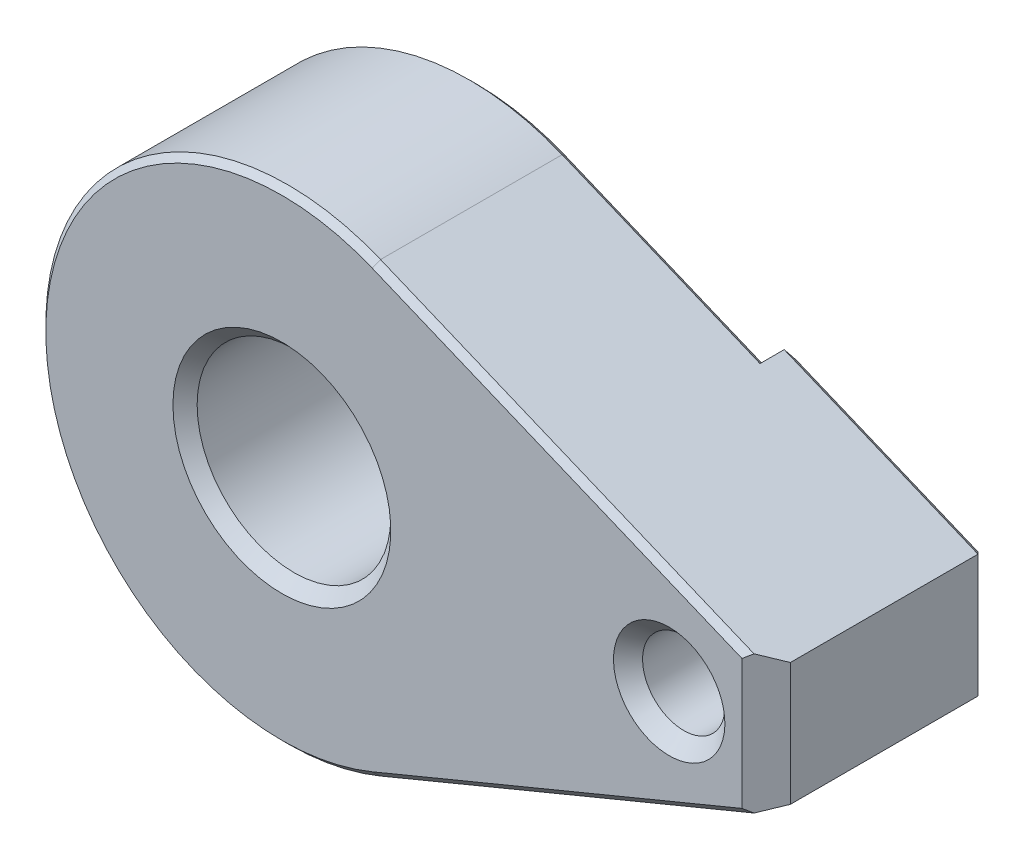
ISO-10303-21;
HEADER;
FILE_DESCRIPTION(('STEP AP214'),'2;1');
FILE_NAME('part.step','',(''),(''),'','','');
FILE_SCHEMA(('AUTOMOTIVE_DESIGN { 1 0 10303 214 1 1 1 1 }'));
ENDSEC;
DATA;
#1=APPLICATION_CONTEXT('core data for automotive mechanical design processes');
#2=APPLICATION_PROTOCOL_DEFINITION('international standard','automotive_design',2000,#1);
#3=PRODUCT_CONTEXT('',#1,'mechanical');
#4=PRODUCT('Part','Part','',(#3));
#5=PRODUCT_RELATED_PRODUCT_CATEGORY('part','',(#4));
#6=PRODUCT_DEFINITION_FORMATION('','',#4);
#7=PRODUCT_DEFINITION_CONTEXT('part definition',#1,'design');
#8=PRODUCT_DEFINITION('design','',#6,#7);
#9=PRODUCT_DEFINITION_SHAPE('','',#8);
#10=(LENGTH_UNIT() NAMED_UNIT(*) SI_UNIT(.MILLI.,.METRE.));
#11=(NAMED_UNIT(*) PLANE_ANGLE_UNIT() SI_UNIT($,.RADIAN.));
#12=(NAMED_UNIT(*) SI_UNIT($,.STERADIAN.) SOLID_ANGLE_UNIT());
#13=UNCERTAINTY_MEASURE_WITH_UNIT(LENGTH_MEASURE(1.E-05),#10,'distance_accuracy_value','');
#14=(GEOMETRIC_REPRESENTATION_CONTEXT(3) GLOBAL_UNCERTAINTY_ASSIGNED_CONTEXT((#13)) GLOBAL_UNIT_ASSIGNED_CONTEXT((#10,
#11,#12)) REPRESENTATION_CONTEXT('',''));
#15=CARTESIAN_POINT('',(0.,0.,0.));
#16=DIRECTION('',(0.,0.,1.));
#17=DIRECTION('',(1.,0.,0.));
#18=AXIS2_PLACEMENT_3D('',#15,#16,#17);
#19=CARTESIAN_POINT('',(24.,20.,0.));
#20=DIRECTION('',(0.,0.,1.));
#21=DIRECTION('',(0.,1.,0.));
#22=AXIS2_PLACEMENT_3D('',#19,#20,#21);
#23=PLANE('',#22);
#24=CARTESIAN_POINT('',(0.,0.,0.));
#25=DIRECTION('',(0.,0.,1.));
#26=DIRECTION('',(0.,1.,0.));
#27=AXIS2_PLACEMENT_3D('',#24,#25,#26);
#28=CIRCLE('',#27,8.5);
#29=CARTESIAN_POINT('',(0.,8.5,0.));
#30=VERTEX_POINT('',#29);
#31=EDGE_CURVE('E262',#30,#30,#28,.T.);
#32=ORIENTED_EDGE('',*,*,#31,.T.);
#33=EDGE_LOOP('',(#32));
#34=FACE_BOUND('',#33,.T.);
#35=DIRECTION('',(0.923879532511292,-0.382683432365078,0.));
#36=VECTOR('',#35,1.);
#37=CARTESIAN_POINT('',(23.8086582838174,11.2447787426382,0.));
#38=LINE('',#37,#36);
#39=CARTESIAN_POINT('',(7.46232693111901,18.0156508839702,0.));
#40=VERTEX_POINT('',#39);
#41=CARTESIAN_POINT('',(23.6,11.3312078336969,0.));
#42=VERTEX_POINT('',#41);
#43=EDGE_CURVE('E207',#40,#42,#38,.T.);
#44=ORIENTED_EDGE('',*,*,#43,.T.);
#45=DIRECTION('',(0.,-1.,0.));
#46=VECTOR('',#45,1.);
#47=CARTESIAN_POINT('',(23.6,-11.1655224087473,0.));
#48=LINE('',#47,#46);
#49=CARTESIAN_POINT('',(23.6,-11.3312078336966,0.));
#50=VERTEX_POINT('',#49);
#51=EDGE_CURVE('E220',#42,#50,#48,.T.);
#52=ORIENTED_EDGE('',*,*,#51,.T.);
#53=DIRECTION('',(-0.923879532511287,-0.382683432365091,0.));
#54=VECTOR('',#53,1.);
#55=CARTESIAN_POINT('',(7.46232693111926,-18.0156508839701,0.));
#56=LINE('',#55,#54);
#57=CARTESIAN_POINT('',(7.46232693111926,-18.0156508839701,0.));
#58=VERTEX_POINT('',#57);
#59=EDGE_CURVE('E212',#50,#58,#56,.T.);
#60=ORIENTED_EDGE('',*,*,#59,.T.);
#61=CARTESIAN_POINT('',(0.,0.,0.));
#62=DIRECTION('',(0.,0.,1.));
#63=DIRECTION('',(0.,1.,0.));
#64=AXIS2_PLACEMENT_3D('',#61,#62,#63);
#65=CIRCLE('',#64,19.5);
#66=EDGE_CURVE('E210',#58,#40,#65,.F.);
#67=ORIENTED_EDGE('',*,*,#66,.T.);
#68=EDGE_LOOP('',(#44,#52,#60,#67));
#69=FACE_BOUND('',#68,.T.);
#70=ADVANCED_FACE('F14',(#34,#69),#23,.F.);
#71=CARTESIAN_POINT('',(24.,20.,0.));
#72=DIRECTION('',(1.,0.,0.));
#73=DIRECTION('',(0.,1.,0.));
#74=AXIS2_PLACEMENT_3D('',#71,#72,#73);
#75=PLANE('',#74);
#76=DIRECTION('',(0.,0.734509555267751,-0.678598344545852));
#77=VECTOR('',#76,1.);
#78=CARTESIAN_POINT('',(24.,5.64841053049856,-15.5340485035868));
#79=LINE('',#78,#77);
#80=CARTESIAN_POINT('',(24.,-11.7067185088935,0.500000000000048));
#81=VERTEX_POINT('',#80);
#82=CARTESIAN_POINT('',(24.,-10.7325655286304,-0.399999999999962));
#83=VERTEX_POINT('',#82);
#84=EDGE_CURVE('E29',#81,#83,#79,.T.);
#85=ORIENTED_EDGE('',*,*,#84,.T.);
#86=DIRECTION('',(0.,-1.,0.));
#87=VECTOR('',#86,1.);
#88=CARTESIAN_POINT('',(24.,11.1655224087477,-0.400000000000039));
#89=LINE('',#88,#87);
#90=CARTESIAN_POINT('',(24.,10.7325655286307,-0.400000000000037));
#91=VERTEX_POINT('',#90);
#92=EDGE_CURVE('E228',#83,#91,#89,.F.);
#93=ORIENTED_EDGE('',*,*,#92,.T.);
#94=DIRECTION('',(0.,0.734509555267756,0.678598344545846));
#95=VECTOR('',#94,1.);
#96=CARTESIAN_POINT('',(24.,15.9317609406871,4.40343022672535));
#97=LINE('',#96,#95);
#98=CARTESIAN_POINT('',(24.,11.7067185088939,0.499999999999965));
#99=VERTEX_POINT('',#98);
#100=EDGE_CURVE('E36',#91,#99,#97,.T.);
#101=ORIENTED_EDGE('',*,*,#100,.T.);
#102=DIRECTION('',(0.,0.,1.));
#103=VECTOR('',#102,1.);
#104=CARTESIAN_POINT('',(24.,11.7067185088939,0.));
#105=LINE('',#104,#103);
#106=CARTESIAN_POINT('',(24.,11.7067185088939,-1.50000000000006));
#107=VERTEX_POINT('',#106);
#108=EDGE_CURVE('E239',#107,#99,#105,.T.);
#109=ORIENTED_EDGE('',*,*,#108,.F.);
#110=DIRECTION('',(0.,-1.,0.));
#111=VECTOR('',#110,1.);
#112=CARTESIAN_POINT('',(24.,20.,-1.50000000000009));
#113=LINE('',#112,#111);
#114=CARTESIAN_POINT('',(24.,-11.7067185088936,-1.49999999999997));
#115=VERTEX_POINT('',#114);
#116=EDGE_CURVE('E161',#107,#115,#113,.T.);
#117=ORIENTED_EDGE('',*,*,#116,.T.);
#118=DIRECTION('',(0.,0.,-1.));
#119=VECTOR('',#118,1.);
#120=CARTESIAN_POINT('',(24.,-11.7067185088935,0.));
#121=LINE('',#120,#119);
#122=EDGE_CURVE('E259',#81,#115,#121,.T.);
#123=ORIENTED_EDGE('',*,*,#122,.F.);
#124=EDGE_LOOP('',(#85,#93,#101,#109,#117,#123));
#125=FACE_BOUND('',#124,.T.);
#126=ADVANCED_FACE('F237',(#125),#75,.F.);
#127=CARTESIAN_POINT('',(24.,20.,-2.00000000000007));
#128=DIRECTION('',(0.,0.,1.));
#129=DIRECTION('',(1.,0.,0.));
#130=AXIS2_PLACEMENT_3D('',#127,#128,#129);
#131=PLANE('',#130);
#132=CARTESIAN_POINT('',(32.,2.16471843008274E-13,-2.));
#133=DIRECTION('',(0.,0.,1.));
#134=DIRECTION('',(1.,0.,0.));
#135=AXIS2_PLACEMENT_3D('',#132,#133,#134);
#136=CIRCLE('',#135,4.6);
#137=CARTESIAN_POINT('',(36.6,2.48593471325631E-13,-2.));
#138=VERTEX_POINT('',#137);
#139=EDGE_CURVE('E192',#138,#138,#136,.T.);
#140=ORIENTED_EDGE('',*,*,#139,.T.);
#141=EDGE_LOOP('',(#140));
#142=FACE_BOUND('',#141,.T.);
#143=DIRECTION('',(0.,-1.,0.));
#144=VECTOR('',#143,1.);
#145=CARTESIAN_POINT('',(39.51,-5.07515937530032,-2.));
#146=LINE('',#145,#144);
#147=CARTESIAN_POINT('',(39.51,4.74107005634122,-2.));
#148=VERTEX_POINT('',#147);
#149=CARTESIAN_POINT('',(39.51,-4.74107005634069,-2.));
#150=VERTEX_POINT('',#149);
#151=EDGE_CURVE('E153',#148,#150,#146,.T.);
#152=ORIENTED_EDGE('',*,*,#151,.T.);
#153=DIRECTION('',(-0.923879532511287,-0.382683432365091,0.));
#154=VECTOR('',#153,1.);
#155=CARTESIAN_POINT('',(23.8086582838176,-11.2447787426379,-1.99999999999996));
#156=LINE('',#155,#154);
#157=CARTESIAN_POINT('',(24.5,-10.9584156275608,-1.99999999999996));
#158=VERTEX_POINT('',#157);
#159=EDGE_CURVE('E155',#150,#158,#156,.T.);
#160=ORIENTED_EDGE('',*,*,#159,.T.);
#161=DIRECTION('',(0.,1.,0.));
#162=VECTOR('',#161,1.);
#163=CARTESIAN_POINT('',(24.5,20.,-2.00000000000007));
#164=LINE('',#163,#162);
#165=CARTESIAN_POINT('',(24.5,10.9584156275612,-2.00000000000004));
#166=VERTEX_POINT('',#165);
#167=EDGE_CURVE('E149',#158,#166,#164,.T.);
#168=ORIENTED_EDGE('',*,*,#167,.T.);
#169=DIRECTION('',(0.923879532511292,-0.382683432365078,0.));
#170=VECTOR('',#169,1.);
#171=CARTESIAN_POINT('',(39.8186582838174,4.61321960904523,-2.));
#172=LINE('',#171,#170);
#173=EDGE_CURVE('E151',#166,#148,#172,.T.);
#174=ORIENTED_EDGE('',*,*,#173,.T.);
#175=EDGE_LOOP('',(#152,#160,#168,#174));
#176=FACE_BOUND('',#175,.T.);
#177=ADVANCED_FACE('F320',(#142,#176),#131,.F.);
#178=CARTESIAN_POINT('',(35.3073372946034,-7.02306604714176,-2.));
#179=DIRECTION('',(0.382683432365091,-0.923879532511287,0.));
#180=DIRECTION('',(0.923879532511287,0.382683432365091,0.));
#181=AXIS2_PLACEMENT_3D('',#178,#179,#180);
#182=PLANE('',#181);
#183=DIRECTION('',(0.,0.,1.));
#184=VECTOR('',#183,1.);
#185=CARTESIAN_POINT('',(7.65366864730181,-18.4775906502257,-1.99999999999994));
#186=LINE('',#185,#184);
#187=CARTESIAN_POINT('',(7.65366864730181,-18.4775906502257,0.500000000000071));
#188=VERTEX_POINT('',#187);
#189=CARTESIAN_POINT('',(7.65366864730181,-18.4775906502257,15.5));
#190=VERTEX_POINT('',#189);
#191=EDGE_CURVE('E251',#188,#190,#186,.T.);
#192=ORIENTED_EDGE('',*,*,#191,.F.);
#193=DIRECTION('',(0.923879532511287,0.382683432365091,0.));
#194=VECTOR('',#193,1.);
#195=CARTESIAN_POINT('',(24.,-11.7067185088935,0.500000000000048));
#196=LINE('',#195,#194);
#197=EDGE_CURVE('E204',#188,#81,#196,.T.);
#198=ORIENTED_EDGE('',*,*,#197,.T.);
#199=ORIENTED_EDGE('',*,*,#122,.T.);
#200=DIRECTION('',(0.923879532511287,0.382683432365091,0.));
#201=VECTOR('',#200,1.);
#202=CARTESIAN_POINT('',(40.01,-5.07515937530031,-1.5));
#203=LINE('',#202,#201);
#204=CARTESIAN_POINT('',(40.01,-5.07515937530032,-1.5));
#205=VERTEX_POINT('',#204);
#206=EDGE_CURVE('E143',#115,#205,#203,.T.);
#207=ORIENTED_EDGE('',*,*,#206,.T.);
#208=DIRECTION('',(0.,0.,1.));
#209=VECTOR('',#208,1.);
#210=CARTESIAN_POINT('',(40.01,-5.07515937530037,-16.8124563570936));
#211=LINE('',#210,#209);
#212=CARTESIAN_POINT('',(40.01,-5.07515937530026,14.));
#213=VERTEX_POINT('',#212);
#214=EDGE_CURVE('E136',#205,#213,#211,.T.);
#215=ORIENTED_EDGE('',*,*,#214,.T.);
#216=DIRECTION('',(-0.678598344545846,-0.281084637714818,0.678598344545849));
#217=VECTOR('',#216,1.);
#218=CARTESIAN_POINT('',(44.8408247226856,-3.07416625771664,9.16917527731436));
#219=LINE('',#218,#217);
#220=CARTESIAN_POINT('',(38.51,-5.6964797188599,15.5));
#221=VERTEX_POINT('',#220);
#222=EDGE_CURVE('E141',#213,#221,#219,.T.);
#223=ORIENTED_EDGE('',*,*,#222,.T.);
#224=DIRECTION('',(-0.923879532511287,-0.382683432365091,0.));
#225=VECTOR('',#224,1.);
#226=CARTESIAN_POINT('',(7.65366864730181,-18.4775906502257,15.5));
#227=LINE('',#226,#225);
#228=EDGE_CURVE('E185',#221,#190,#227,.T.);
#229=ORIENTED_EDGE('',*,*,#228,.T.);
#230=EDGE_LOOP('',(#192,#198,#199,#207,#215,#223,#229));
#231=FACE_BOUND('',#230,.T.);
#232=ADVANCED_FACE('F289',(#231),#182,.T.);
#233=CARTESIAN_POINT('',(35.3073372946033,7.02306604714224,-2.00000000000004));
#234=DIRECTION('',(0.382683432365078,0.923879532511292,0.));
#235=DIRECTION('',(-0.923879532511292,0.382683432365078,0.));
#236=AXIS2_PLACEMENT_3D('',#233,#234,#235);
#237=PLANE('',#236);
#238=ORIENTED_EDGE('',*,*,#108,.T.);
#239=DIRECTION('',(-0.923879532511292,0.382683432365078,0.));
#240=VECTOR('',#239,1.);
#241=CARTESIAN_POINT('',(7.65366864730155,18.4775906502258,0.499999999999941));
#242=LINE('',#241,#240);
#243=CARTESIAN_POINT('',(7.65366864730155,18.4775906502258,0.499999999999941));
#244=VERTEX_POINT('',#243);
#245=EDGE_CURVE('E216',#99,#244,#242,.T.);
#246=ORIENTED_EDGE('',*,*,#245,.T.);
#247=DIRECTION('',(0.,0.,1.));
#248=VECTOR('',#247,1.);
#249=CARTESIAN_POINT('',(7.65366864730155,18.4775906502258,-2.00000000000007));
#250=LINE('',#249,#248);
#251=CARTESIAN_POINT('',(7.65366864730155,18.4775906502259,15.5));
#252=VERTEX_POINT('',#251);
#253=EDGE_CURVE('E246',#244,#252,#250,.T.);
#254=ORIENTED_EDGE('',*,*,#253,.T.);
#255=DIRECTION('',(0.923879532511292,-0.382683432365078,0.));
#256=VECTOR('',#255,1.);
#257=CARTESIAN_POINT('',(38.01,5.90358650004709,15.5));
#258=LINE('',#257,#256);
#259=CARTESIAN_POINT('',(38.51,5.69647971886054,15.5));
#260=VERTEX_POINT('',#259);
#261=EDGE_CURVE('E121',#252,#260,#258,.T.);
#262=ORIENTED_EDGE('',*,*,#261,.T.);
#263=DIRECTION('',(0.67859834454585,-0.281084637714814,-0.678598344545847));
#264=VECTOR('',#263,1.);
#265=CARTESIAN_POINT('',(44.8408247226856,3.07416625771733,9.16917527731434));
#266=LINE('',#265,#264);
#267=CARTESIAN_POINT('',(40.01,5.07515937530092,14.));
#268=VERTEX_POINT('',#267);
#269=EDGE_CURVE('E115',#260,#268,#266,.T.);
#270=ORIENTED_EDGE('',*,*,#269,.T.);
#271=DIRECTION('',(0.,0.,1.));
#272=VECTOR('',#271,1.);
#273=CARTESIAN_POINT('',(40.01,5.07515937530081,-16.8124563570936));
#274=LINE('',#273,#272);
#275=CARTESIAN_POINT('',(40.01,5.07515937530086,-1.50000000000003));
#276=VERTEX_POINT('',#275);
#277=EDGE_CURVE('E118',#276,#268,#274,.T.);
#278=ORIENTED_EDGE('',*,*,#277,.F.);
#279=DIRECTION('',(-0.923879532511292,0.382683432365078,0.));
#280=VECTOR('',#279,1.);
#281=CARTESIAN_POINT('',(24.,11.7067185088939,-1.50000000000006));
#282=LINE('',#281,#280);
#283=EDGE_CURVE('E159',#276,#107,#282,.T.);
#284=ORIENTED_EDGE('',*,*,#283,.T.);
#285=EDGE_LOOP('',(#238,#246,#254,#262,#270,#278,#284));
#286=FACE_BOUND('',#285,.T.);
#287=ADVANCED_FACE('F117',(#286),#237,.T.);
#288=CARTESIAN_POINT('',(0.,0.,-2.));
#289=DIRECTION('',(0.,0.,1.));
#290=DIRECTION('',(1.,0.,0.));
#291=AXIS2_PLACEMENT_3D('',#288,#289,#290);
#292=CYLINDRICAL_SURFACE('',#291,20.);
#293=ORIENTED_EDGE('',*,*,#253,.F.);
#294=CARTESIAN_POINT('',(0.,0.,0.500000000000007));
#295=DIRECTION('',(0.,0.,1.));
#296=DIRECTION('',(1.,0.,0.));
#297=AXIS2_PLACEMENT_3D('',#294,#295,#296);
#298=CIRCLE('',#297,20.);
#299=EDGE_CURVE('E214',#244,#188,#298,.T.);
#300=ORIENTED_EDGE('',*,*,#299,.T.);
#301=ORIENTED_EDGE('',*,*,#191,.T.);
#302=CARTESIAN_POINT('',(0.,0.,15.5));
#303=DIRECTION('',(0.,0.,-1.));
#304=DIRECTION('',(-1.,0.,0.));
#305=AXIS2_PLACEMENT_3D('',#302,#303,#304);
#306=CIRCLE('',#305,20.);
#307=EDGE_CURVE('E188',#190,#252,#306,.T.);
#308=ORIENTED_EDGE('',*,*,#307,.T.);
#309=EDGE_LOOP('',(#293,#300,#301,#308));
#310=FACE_BOUND('',#309,.T.);
#311=ADVANCED_FACE('F248',(#310),#292,.T.);
#312=CARTESIAN_POINT('',(-20.,20.,16.));
#313=DIRECTION('',(0.,0.,-1.));
#314=DIRECTION('',(-1.,0.,0.));
#315=AXIS2_PLACEMENT_3D('',#312,#313,#314);
#316=PLANE('',#315);
#317=CARTESIAN_POINT('',(0.,0.,16.));
#318=DIRECTION('',(0.,0.,-1.));
#319=DIRECTION('',(-1.,0.,0.));
#320=AXIS2_PLACEMENT_3D('',#317,#318,#319);
#321=CIRCLE('',#320,9.);
#322=CARTESIAN_POINT('',(-9.,0.,16.));
#323=VERTEX_POINT('',#322);
#324=EDGE_CURVE('E271',#323,#323,#321,.T.);
#325=ORIENTED_EDGE('',*,*,#324,.T.);
#326=EDGE_LOOP('',(#325));
#327=FACE_BOUND('',#326,.T.);
#328=CARTESIAN_POINT('',(32.,2.7931850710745E-13,16.));
#329=DIRECTION('',(0.,0.,1.));
#330=DIRECTION('',(0.,1.,0.));
#331=AXIS2_PLACEMENT_3D('',#328,#329,#330);
#332=CIRCLE('',#331,4.6);
#333=CARTESIAN_POINT('',(32.,4.60000000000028,16.));
#334=VERTEX_POINT('',#333);
#335=EDGE_CURVE('E135',#334,#334,#332,.T.);
#336=ORIENTED_EDGE('',*,*,#335,.F.);
#337=EDGE_LOOP('',(#336));
#338=FACE_BOUND('',#337,.T.);
#339=CARTESIAN_POINT('',(0.,0.,16.));
#340=DIRECTION('',(0.,0.,-1.));
#341=DIRECTION('',(-1.,0.,0.));
#342=AXIS2_PLACEMENT_3D('',#339,#340,#341);
#343=CIRCLE('',#342,19.5);
#344=CARTESIAN_POINT('',(7.46232693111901,18.0156508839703,16.));
#345=VERTEX_POINT('',#344);
#346=CARTESIAN_POINT('',(7.46232693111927,-18.01565088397,16.));
#347=VERTEX_POINT('',#346);
#348=EDGE_CURVE('E176',#345,#347,#343,.F.);
#349=ORIENTED_EDGE('',*,*,#348,.T.);
#350=DIRECTION('',(0.923879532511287,0.382683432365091,0.));
#351=VECTOR('',#350,1.);
#352=CARTESIAN_POINT('',(37.8186582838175,-5.4416467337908,16.));
#353=LINE('',#352,#351);
#354=CARTESIAN_POINT('',(38.01,-5.36239039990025,16.));
#355=VERTEX_POINT('',#354);
#356=EDGE_CURVE('E178',#347,#355,#353,.T.);
#357=ORIENTED_EDGE('',*,*,#356,.T.);
#358=DIRECTION('',(0.,1.,0.));
#359=VECTOR('',#358,1.);
#360=CARTESIAN_POINT('',(38.01,5.07515937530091,16.));
#361=LINE('',#360,#359);
#362=CARTESIAN_POINT('',(38.01,5.36239039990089,16.));
#363=VERTEX_POINT('',#362);
#364=EDGE_CURVE('E126',#355,#363,#361,.T.);
#365=ORIENTED_EDGE('',*,*,#364,.T.);
#366=DIRECTION('',(-0.923879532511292,0.382683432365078,0.));
#367=VECTOR('',#366,1.);
#368=CARTESIAN_POINT('',(7.46232693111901,18.0156508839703,16.));
#369=LINE('',#368,#367);
#370=EDGE_CURVE('E163',#363,#345,#369,.T.);
#371=ORIENTED_EDGE('',*,*,#370,.T.);
#372=EDGE_LOOP('',(#349,#357,#365,#371));
#373=FACE_BOUND('',#372,.T.);
#374=ADVANCED_FACE('F276',(#327,#338,#373),#316,.F.);
#375=CARTESIAN_POINT('',(32.,2.7931850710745E-13,16.));
#376=DIRECTION('',(0.,0.,1.));
#377=DIRECTION('',(0.,1.,0.));
#378=AXIS2_PLACEMENT_3D('',#375,#376,#377);
#379=CYLINDRICAL_SURFACE('',#378,3.4);
#380=CARTESIAN_POINT('',(32.,2.20661620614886E-13,-0.8));
#381=DIRECTION('',(0.,0.,1.));
#382=DIRECTION('',(0.,1.,0.));
#383=AXIS2_PLACEMENT_3D('',#380,#381,#382);
#384=CIRCLE('',#383,3.4);
#385=CARTESIAN_POINT('',(32.,3.40000000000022,-0.800000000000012));
#386=VERTEX_POINT('',#385);
#387=EDGE_CURVE('E201',#386,#386,#384,.F.);
#388=ORIENTED_EDGE('',*,*,#387,.T.);
#389=EDGE_LOOP('',(#388));
#390=FACE_BOUND('',#389,.T.);
#391=CARTESIAN_POINT('',(32.,2.75128729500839E-13,14.8));
#392=DIRECTION('',(0.,0.,1.));
#393=DIRECTION('',(0.,1.,0.));
#394=AXIS2_PLACEMENT_3D('',#391,#392,#393);
#395=CIRCLE('',#394,3.4);
#396=CARTESIAN_POINT('',(32.,3.40000000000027,14.8));
#397=VERTEX_POINT('',#396);
#398=EDGE_CURVE('E252',#397,#397,#395,.T.);
#399=ORIENTED_EDGE('',*,*,#398,.T.);
#400=EDGE_LOOP('',(#399));
#401=FACE_BOUND('',#400,.T.);
#402=ADVANCED_FACE('F299',(#390,#401),#379,.F.);
#403=CARTESIAN_POINT('',(32.,2.7931850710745E-13,16.));
#404=DIRECTION('',(0.,0.,1.));
#405=DIRECTION('',(0.,1.,0.));
#406=AXIS2_PLACEMENT_3D('',#403,#404,#405);
#407=CONICAL_SURFACE('',#406,4.6,0.785398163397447);
#408=ORIENTED_EDGE('',*,*,#398,.F.);
#409=EDGE_LOOP('',(#408));
#410=FACE_BOUND('',#409,.T.);
#411=ORIENTED_EDGE('',*,*,#335,.T.);
#412=EDGE_LOOP('',(#411));
#413=FACE_BOUND('',#412,.T.);
#414=ADVANCED_FACE('F296',(#410,#413),#407,.F.);
#415=CARTESIAN_POINT('',(40.01,-5.07515937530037,-16.8124563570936));
#416=DIRECTION('',(1.,0.,0.));
#417=DIRECTION('',(0.,0.,-1.));
#418=AXIS2_PLACEMENT_3D('',#415,#416,#417);
#419=PLANE('',#418);
#420=ORIENTED_EDGE('',*,*,#214,.F.);
#421=DIRECTION('',(0.,1.,0.));
#422=VECTOR('',#421,1.);
#423=CARTESIAN_POINT('',(40.01,5.07515937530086,-1.50000000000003));
#424=LINE('',#423,#422);
#425=EDGE_CURVE('E134',#205,#276,#424,.T.);
#426=ORIENTED_EDGE('',*,*,#425,.T.);
#427=ORIENTED_EDGE('',*,*,#277,.T.);
#428=DIRECTION('',(0.,-1.,0.));
#429=VECTOR('',#428,1.);
#430=CARTESIAN_POINT('',(40.01,-5.07515937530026,14.));
#431=LINE('',#430,#429);
#432=EDGE_CURVE('E125',#268,#213,#431,.T.);
#433=ORIENTED_EDGE('',*,*,#432,.T.);
#434=EDGE_LOOP('',(#420,#426,#427,#433));
#435=FACE_BOUND('',#434,.T.);
#436=ADVANCED_FACE('F131',(#435),#419,.T.);
#437=CARTESIAN_POINT('',(0.,0.,-2.));
#438=DIRECTION('',(0.,0.,1.));
#439=DIRECTION('',(1.,0.,0.));
#440=AXIS2_PLACEMENT_3D('',#437,#438,#439);
#441=CYLINDRICAL_SURFACE('',#440,8.);
#442=CARTESIAN_POINT('',(0.,0.,15.));
#443=DIRECTION('',(0.,0.,-1.));
#444=DIRECTION('',(-1.,0.,0.));
#445=AXIS2_PLACEMENT_3D('',#442,#443,#444);
#446=CIRCLE('',#445,8.);
#447=CARTESIAN_POINT('',(-8.,0.,15.));
#448=VERTEX_POINT('',#447);
#449=EDGE_CURVE('E268',#448,#448,#446,.F.);
#450=ORIENTED_EDGE('',*,*,#449,.T.);
#451=EDGE_LOOP('',(#450));
#452=FACE_BOUND('',#451,.T.);
#453=CARTESIAN_POINT('',(0.,0.,0.5));
#454=DIRECTION('',(0.,0.,1.));
#455=DIRECTION('',(1.,0.,0.));
#456=AXIS2_PLACEMENT_3D('',#453,#454,#455);
#457=CIRCLE('',#456,8.);
#458=CARTESIAN_POINT('',(8.,0.,0.499999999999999));
#459=VERTEX_POINT('',#458);
#460=EDGE_CURVE('E265',#459,#459,#457,.F.);
#461=ORIENTED_EDGE('',*,*,#460,.T.);
#462=EDGE_LOOP('',(#461));
#463=FACE_BOUND('',#462,.T.);
#464=ADVANCED_FACE('F387',(#452,#463),#441,.F.);
#465=CARTESIAN_POINT('',(0.,0.,0.));
#466=DIRECTION('',(0.,0.,-1.));
#467=DIRECTION('',(-1.,0.,0.));
#468=AXIS2_PLACEMENT_3D('',#465,#466,#467);
#469=CONICAL_SURFACE('',#468,8.5,0.785398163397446);
#470=ORIENTED_EDGE('',*,*,#460,.F.);
#471=EDGE_LOOP('',(#470));
#472=FACE_BOUND('',#471,.T.);
#473=ORIENTED_EDGE('',*,*,#31,.F.);
#474=EDGE_LOOP('',(#473));
#475=FACE_BOUND('',#474,.T.);
#476=ADVANCED_FACE('F384',(#472,#475),#469,.F.);
#477=CARTESIAN_POINT('',(0.,0.,15.));
#478=DIRECTION('',(0.,0.,1.));
#479=DIRECTION('',(1.,0.,0.));
#480=AXIS2_PLACEMENT_3D('',#477,#478,#479);
#481=CONICAL_SURFACE('',#480,8.,0.785398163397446);
#482=ORIENTED_EDGE('',*,*,#324,.F.);
#483=EDGE_LOOP('',(#482));
#484=FACE_BOUND('',#483,.T.);
#485=ORIENTED_EDGE('',*,*,#449,.F.);
#486=EDGE_LOOP('',(#485));
#487=FACE_BOUND('',#486,.T.);
#488=ADVANCED_FACE('F382',(#484,#487),#481,.F.);
#489=CARTESIAN_POINT('',(38.01,20.0000000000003,16.));
#490=DIRECTION('',(0.707106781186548,0.,0.707106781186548));
#491=DIRECTION('',(0.,-1.,0.));
#492=AXIS2_PLACEMENT_3D('',#489,#490,#491);
#493=PLANE('',#492);
#494=ORIENTED_EDGE('',*,*,#364,.F.);
#495=DIRECTION('',(0.639338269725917,-0.42719217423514,-0.639338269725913));
#496=VECTOR('',#495,1.);
#497=CARTESIAN_POINT('',(31.0830161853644,-0.733927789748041,22.9269838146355));
#498=LINE('',#497,#496);
#499=EDGE_CURVE('E183',#355,#221,#498,.T.);
#500=ORIENTED_EDGE('',*,*,#499,.T.);
#501=ORIENTED_EDGE('',*,*,#222,.F.);
#502=ORIENTED_EDGE('',*,*,#432,.F.);
#503=ORIENTED_EDGE('',*,*,#269,.F.);
#504=DIRECTION('',(-0.639338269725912,-0.427192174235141,0.639338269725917));
#505=VECTOR('',#504,1.);
#506=CARTESIAN_POINT('',(42.0078284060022,8.03365393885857,12.0021715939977));
#507=LINE('',#506,#505);
#508=EDGE_CURVE('E181',#260,#363,#507,.T.);
#509=ORIENTED_EDGE('',*,*,#508,.T.);
#510=EDGE_LOOP('',(#494,#500,#501,#502,#503,#509));
#511=FACE_BOUND('',#510,.T.);
#512=ADVANCED_FACE('F139',(#511),#493,.T.);
#513=CARTESIAN_POINT('',(35.3073372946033,7.02306604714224,-1.50000000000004));
#514=DIRECTION('',(0.270598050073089,0.653281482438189,-0.70710678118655));
#515=DIRECTION('',(0.923879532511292,-0.382683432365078,0.));
#516=AXIS2_PLACEMENT_3D('',#513,#514,#515);
#517=PLANE('',#516);
#518=DIRECTION('',(-0.63933826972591,-0.427192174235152,-0.639338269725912));
#519=VECTOR('',#518,1.);
#520=CARTESIAN_POINT('',(38.6197833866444,4.14624633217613,-2.89021661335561));
#521=LINE('',#520,#519);
#522=EDGE_CURVE('E169',#148,#276,#521,.F.);
#523=ORIENTED_EDGE('',*,*,#522,.F.);
#524=ORIENTED_EDGE('',*,*,#173,.F.);
#525=DIRECTION('',(-0.48565273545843,0.72683068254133,0.485652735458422));
#526=VECTOR('',#525,1.);
#527=CARTESIAN_POINT('',(21.0725768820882,16.0879168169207,1.42742311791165));
#528=LINE('',#527,#526);
#529=EDGE_CURVE('E172',#107,#166,#528,.F.);
#530=ORIENTED_EDGE('',*,*,#529,.F.);
#531=ORIENTED_EDGE('',*,*,#283,.F.);
#532=EDGE_LOOP('',(#523,#524,#530,#531));
#533=FACE_BOUND('',#532,.T.);
#534=ADVANCED_FACE('F345',(#533),#517,.T.);
#535=CARTESIAN_POINT('',(24.,20.,-1.50000000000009));
#536=DIRECTION('',(0.707106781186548,0.,0.707106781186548));
#537=DIRECTION('',(0.,-1.,0.));
#538=AXIS2_PLACEMENT_3D('',#535,#536,#537);
#539=PLANE('',#538);
#540=ORIENTED_EDGE('',*,*,#529,.T.);
#541=ORIENTED_EDGE('',*,*,#167,.F.);
#542=DIRECTION('',(0.485652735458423,0.726830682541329,-0.485652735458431));
#543=VECTOR('',#542,1.);
#544=CARTESIAN_POINT('',(35.1920692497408,5.04339682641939,-12.6920692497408));
#545=LINE('',#544,#543);
#546=EDGE_CURVE('E166',#115,#158,#545,.T.);
#547=ORIENTED_EDGE('',*,*,#546,.F.);
#548=ORIENTED_EDGE('',*,*,#116,.F.);
#549=EDGE_LOOP('',(#540,#541,#547,#548));
#550=FACE_BOUND('',#549,.T.);
#551=ADVANCED_FACE('F348',(#550),#539,.F.);
#552=CARTESIAN_POINT('',(39.51,20.0000000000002,-2.00000000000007));
#553=DIRECTION('',(0.707106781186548,0.,-0.707106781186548));
#554=DIRECTION('',(0.,1.,0.));
#555=AXIS2_PLACEMENT_3D('',#552,#553,#554);
#556=PLANE('',#555);
#557=ORIENTED_EDGE('',*,*,#522,.T.);
#558=ORIENTED_EDGE('',*,*,#425,.F.);
#559=DIRECTION('',(-0.63933826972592,0.427192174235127,-0.639338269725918));
#560=VECTOR('',#559,1.);
#561=CARTESIAN_POINT('',(32.7527113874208,-0.225994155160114,-8.7572886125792));
#562=LINE('',#561,#560);
#563=EDGE_CURVE('E164',#150,#205,#562,.F.);
#564=ORIENTED_EDGE('',*,*,#563,.F.);
#565=ORIENTED_EDGE('',*,*,#151,.F.);
#566=EDGE_LOOP('',(#557,#558,#564,#565));
#567=FACE_BOUND('',#566,.T.);
#568=ADVANCED_FACE('F343',(#567),#556,.T.);
#569=CARTESIAN_POINT('',(35.3073372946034,-7.02306604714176,-1.5));
#570=DIRECTION('',(0.270598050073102,-0.653281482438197,-0.707106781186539));
#571=DIRECTION('',(-0.923879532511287,-0.382683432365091,0.));
#572=AXIS2_PLACEMENT_3D('',#569,#570,#571);
#573=PLANE('',#572);
#574=ORIENTED_EDGE('',*,*,#546,.T.);
#575=ORIENTED_EDGE('',*,*,#159,.F.);
#576=ORIENTED_EDGE('',*,*,#563,.T.);
#577=ORIENTED_EDGE('',*,*,#206,.F.);
#578=EDGE_LOOP('',(#574,#575,#576,#577));
#579=FACE_BOUND('',#578,.T.);
#580=ADVANCED_FACE('F340',(#579),#573,.T.);
#581=CARTESIAN_POINT('',(-16.679808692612,28.0156508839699,16.));
#582=DIRECTION('',(0.270598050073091,0.653281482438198,0.707106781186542));
#583=DIRECTION('',(0.923879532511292,-0.382683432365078,0.));
#584=AXIS2_PLACEMENT_3D('',#581,#582,#583);
#585=PLANE('',#584);
#586=ORIENTED_EDGE('',*,*,#508,.F.);
#587=ORIENTED_EDGE('',*,*,#261,.F.);
#588=DIRECTION('',(0.270598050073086,0.653281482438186,-0.707106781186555));
#589=VECTOR('',#588,1.);
#590=CARTESIAN_POINT('',(7.46232693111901,18.0156508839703,16.));
#591=LINE('',#590,#589);
#592=EDGE_CURVE('E167',#345,#252,#591,.T.);
#593=ORIENTED_EDGE('',*,*,#592,.F.);
#594=ORIENTED_EDGE('',*,*,#370,.F.);
#595=EDGE_LOOP('',(#586,#587,#593,#594));
#596=FACE_BOUND('',#595,.T.);
#597=ADVANCED_FACE('F280',(#596),#585,.T.);
#598=CARTESIAN_POINT('',(0.,0.,16.));
#599=DIRECTION('',(0.,0.,-1.));
#600=DIRECTION('',(-1.,0.,0.));
#601=AXIS2_PLACEMENT_3D('',#598,#599,#600);
#602=CONICAL_SURFACE('',#601,19.5,0.785398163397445);
#603=ORIENTED_EDGE('',*,*,#592,.T.);
#604=ORIENTED_EDGE('',*,*,#307,.F.);
#605=DIRECTION('',(0.270598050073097,-0.653281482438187,-0.707106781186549));
#606=VECTOR('',#605,1.);
#607=CARTESIAN_POINT('',(7.46232693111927,-18.01565088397,16.));
#608=LINE('',#607,#606);
#609=EDGE_CURVE('E193',#347,#190,#608,.T.);
#610=ORIENTED_EDGE('',*,*,#609,.F.);
#611=ORIENTED_EDGE('',*,*,#348,.F.);
#612=EDGE_LOOP('',(#603,#604,#610,#611));
#613=FACE_BOUND('',#612,.T.);
#614=ADVANCED_FACE('F284',(#613),#602,.T.);
#615=CARTESIAN_POINT('',(-2.53767306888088,-22.1577865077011,16.));
#616=DIRECTION('',(0.2705980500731,-0.653281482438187,0.707106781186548));
#617=DIRECTION('',(-0.923879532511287,-0.382683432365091,0.));
#618=AXIS2_PLACEMENT_3D('',#615,#616,#617);
#619=PLANE('',#618);
#620=ORIENTED_EDGE('',*,*,#609,.T.);
#621=ORIENTED_EDGE('',*,*,#228,.F.);
#622=ORIENTED_EDGE('',*,*,#499,.F.);
#623=ORIENTED_EDGE('',*,*,#356,.F.);
#624=EDGE_LOOP('',(#620,#621,#622,#623));
#625=FACE_BOUND('',#624,.T.);
#626=ADVANCED_FACE('F287',(#625),#619,.T.);
#627=CARTESIAN_POINT('',(32.,2.16471843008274E-13,-2.));
#628=DIRECTION('',(0.,0.,-1.));
#629=DIRECTION('',(0.,-1.,0.));
#630=AXIS2_PLACEMENT_3D('',#627,#628,#629);
#631=CONICAL_SURFACE('',#630,4.6,0.785398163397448);
#632=ORIENTED_EDGE('',*,*,#387,.F.);
#633=EDGE_LOOP('',(#632));
#634=FACE_BOUND('',#633,.T.);
#635=ORIENTED_EDGE('',*,*,#139,.F.);
#636=EDGE_LOOP('',(#635));
#637=FACE_BOUND('',#636,.T.);
#638=ADVANCED_FACE('F361',(#634,#637),#631,.F.);
#639=CARTESIAN_POINT('',(35.3073372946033,7.02306604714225,0.499999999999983));
#640=DIRECTION('',(0.27059805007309,0.65328148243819,-0.707106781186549));
#641=DIRECTION('',(0.923879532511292,-0.382683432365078,0.));
#642=AXIS2_PLACEMENT_3D('',#639,#640,#641);
#643=PLANE('',#642);
#644=ORIENTED_EDGE('',*,*,#100,.F.);
#645=CARTESIAN_POINT('',(23.6,10.89825095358,-0.400000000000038));
#646=DIRECTION('',(0.27059805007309,0.65328148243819,-0.707106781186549));
#647=DIRECTION('',(-0.23348720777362,0.757115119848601,0.610131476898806));
#648=AXIS2_PLACEMENT_3D('',#645,#646,#647);
#649=ELLIPSE('',#648,0.612293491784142,0.4);
#650=EDGE_CURVE('E9',#91,#42,#649,.F.);
#651=ORIENTED_EDGE('',*,*,#650,.T.);
#652=ORIENTED_EDGE('',*,*,#43,.F.);
#653=DIRECTION('',(-0.270598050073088,-0.653281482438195,-0.707106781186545));
#654=VECTOR('',#653,1.);
#655=CARTESIAN_POINT('',(7.65366864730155,18.4775906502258,0.499999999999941));
#656=LINE('',#655,#654);
#657=EDGE_CURVE('E196',#244,#40,#656,.T.);
#658=ORIENTED_EDGE('',*,*,#657,.F.);
#659=ORIENTED_EDGE('',*,*,#245,.F.);
#660=EDGE_LOOP('',(#644,#651,#652,#658,#659));
#661=FACE_BOUND('',#660,.T.);
#662=ADVANCED_FACE('F242',(#661),#643,.T.);
#663=CARTESIAN_POINT('',(0.,0.,0.500000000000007));
#664=DIRECTION('',(0.,0.,1.));
#665=DIRECTION('',(1.,0.,0.));
#666=AXIS2_PLACEMENT_3D('',#663,#664,#665);
#667=CONICAL_SURFACE('',#666,20.,0.785398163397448);
#668=ORIENTED_EDGE('',*,*,#657,.T.);
#669=ORIENTED_EDGE('',*,*,#66,.F.);
#670=DIRECTION('',(-0.2705980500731,0.653281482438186,-0.70710678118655));
#671=VECTOR('',#670,1.);
#672=CARTESIAN_POINT('',(7.65366864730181,-18.4775906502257,0.500000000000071));
#673=LINE('',#672,#671);
#674=EDGE_CURVE('E221',#188,#58,#673,.T.);
#675=ORIENTED_EDGE('',*,*,#674,.F.);
#676=ORIENTED_EDGE('',*,*,#299,.F.);
#677=EDGE_LOOP('',(#668,#669,#675,#676));
#678=FACE_BOUND('',#677,.T.);
#679=ADVANCED_FACE('F352',(#678),#667,.T.);
#680=CARTESIAN_POINT('',(35.3073372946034,-7.02306604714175,0.500000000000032));
#681=DIRECTION('',(0.2705980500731,-0.653281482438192,-0.707106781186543));
#682=DIRECTION('',(-0.923879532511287,-0.382683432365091,0.));
#683=AXIS2_PLACEMENT_3D('',#680,#681,#682);
#684=PLANE('',#683);
#685=ORIENTED_EDGE('',*,*,#674,.T.);
#686=ORIENTED_EDGE('',*,*,#59,.F.);
#687=CARTESIAN_POINT('',(23.6,-10.8982509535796,-0.399999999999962));
#688=DIRECTION('',(0.2705980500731,-0.653281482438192,-0.707106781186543));
#689=DIRECTION('',(0.23348720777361,0.757115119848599,-0.610131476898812));
#690=AXIS2_PLACEMENT_3D('',#687,#688,#689);
#691=ELLIPSE('',#690,0.612293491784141,0.4);
#692=EDGE_CURVE('E22',#50,#83,#691,.F.);
#693=ORIENTED_EDGE('',*,*,#692,.T.);
#694=ORIENTED_EDGE('',*,*,#84,.F.);
#695=ORIENTED_EDGE('',*,*,#197,.F.);
#696=EDGE_LOOP('',(#685,#686,#693,#694,#695));
#697=FACE_BOUND('',#696,.T.);
#698=ADVANCED_FACE('F232',(#697),#684,.T.);
#699=CARTESIAN_POINT('',(23.6,20.,-0.40000000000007));
#700=DIRECTION('',(0.,1.,0.));
#701=DIRECTION('',(-1.,0.,0.));
#702=AXIS2_PLACEMENT_3D('',#699,#700,#701);
#703=CYLINDRICAL_SURFACE('',#702,0.4);
#704=ORIENTED_EDGE('',*,*,#650,.F.);
#705=ORIENTED_EDGE('',*,*,#92,.F.);
#706=ORIENTED_EDGE('',*,*,#692,.F.);
#707=ORIENTED_EDGE('',*,*,#51,.F.);
#708=EDGE_LOOP('',(#704,#705,#706,#707));
#709=FACE_BOUND('',#708,.T.);
#710=ADVANCED_FACE('F16',(#709),#703,.F.);
#711=CLOSED_SHELL('',(#70,#126,#177,#232,#287,#311,#374,#402,#414,#436,#464,#476,#488,#512,#534,
#551,#568,#580,#597,#614,#626,#638,#662,#679,#698,#710));
#712=MANIFOLD_SOLID_BREP('B1',#711);
#713=ADVANCED_BREP_SHAPE_REPRESENTATION('',(#18,#712),#14);
#714=SHAPE_DEFINITION_REPRESENTATION(#9,#713);
ENDSEC;
END-ISO-10303-21;
